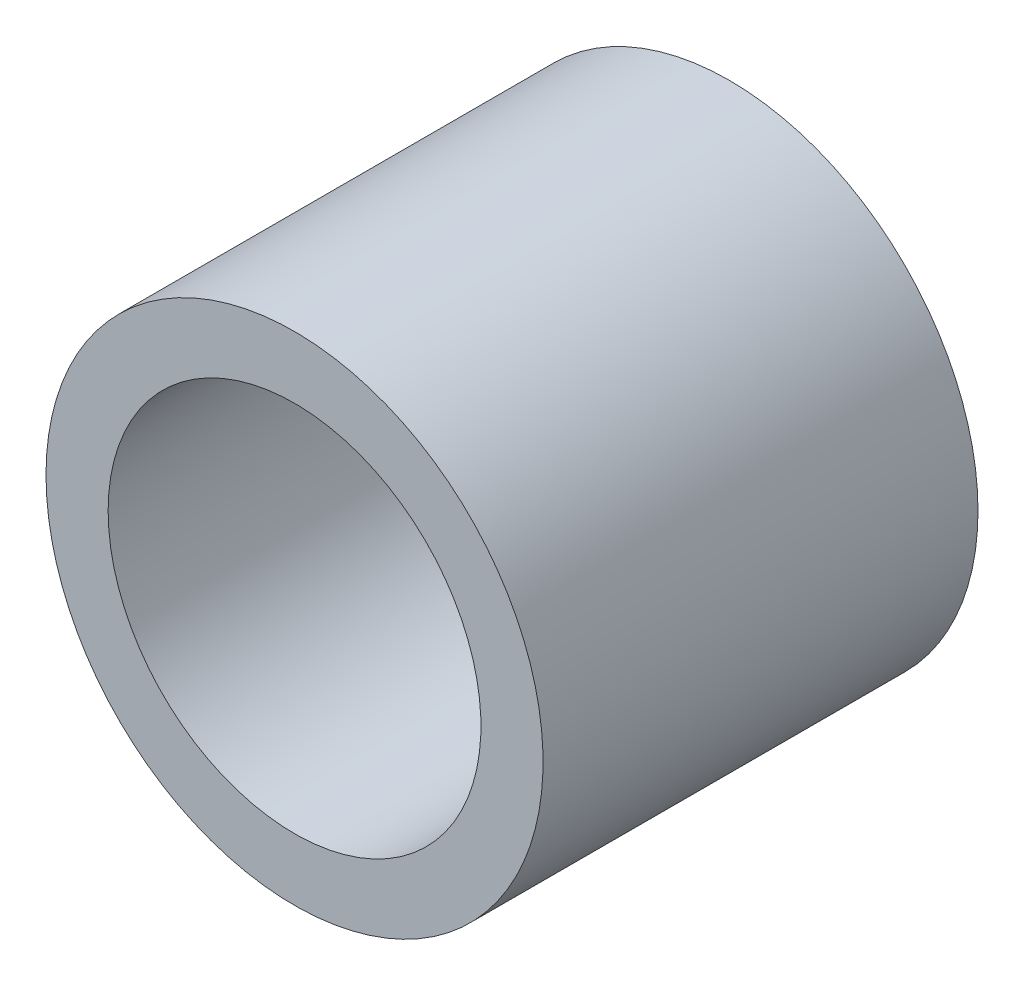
from build123d import *

# Parameters (mm, degrees)
SKETCH_1_R      = 4
SKETCH_1_R_2    = 3
EXTRUDE_1_DEPTH = 7


with BuildPart() as part:
    # Sketch 1 → Extrude 1 (new body)
    with BuildSketch(Plane.XY):
        with Locations(Location((-14.156884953, 25, 0), (0, 0, 180))):
            Circle(SKETCH_1_R)
        with Locations(Location((-14.156884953, 25, 0), (0, 0, 180))):
            Circle(SKETCH_1_R_2, mode=Mode.SUBTRACT)
    extrude(amount=EXTRUDE_1_DEPTH)


solid = part.part
